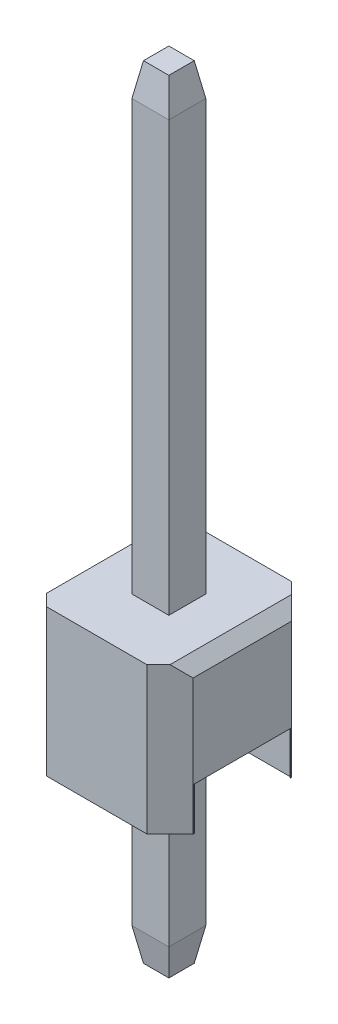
ISO-10303-21;
HEADER;
FILE_DESCRIPTION(('STEP AP214'),'2;1');
FILE_NAME('part.step','',(''),(''),'','','');
FILE_SCHEMA(('AUTOMOTIVE_DESIGN { 1 0 10303 214 1 1 1 1 }'));
ENDSEC;
DATA;
#1=APPLICATION_CONTEXT('core data for automotive mechanical design processes');
#2=APPLICATION_PROTOCOL_DEFINITION('international standard','automotive_design',2000,#1);
#3=PRODUCT_CONTEXT('',#1,'mechanical');
#4=PRODUCT('Part','Part','',(#3));
#5=PRODUCT_RELATED_PRODUCT_CATEGORY('part','',(#4));
#6=PRODUCT_DEFINITION_FORMATION('','',#4);
#7=PRODUCT_DEFINITION_CONTEXT('part definition',#1,'design');
#8=PRODUCT_DEFINITION('design','',#6,#7);
#9=PRODUCT_DEFINITION_SHAPE('','',#8);
#10=(LENGTH_UNIT() NAMED_UNIT(*) SI_UNIT(.MILLI.,.METRE.));
#11=(NAMED_UNIT(*) PLANE_ANGLE_UNIT() SI_UNIT($,.RADIAN.));
#12=(NAMED_UNIT(*) SI_UNIT($,.STERADIAN.) SOLID_ANGLE_UNIT());
#13=UNCERTAINTY_MEASURE_WITH_UNIT(LENGTH_MEASURE(1.E-05),#10,'distance_accuracy_value','');
#14=(GEOMETRIC_REPRESENTATION_CONTEXT(3) GLOBAL_UNCERTAINTY_ASSIGNED_CONTEXT((#13)) GLOBAL_UNIT_ASSIGNED_CONTEXT((#10,
#11,#12)) REPRESENTATION_CONTEXT('',''));
#15=CARTESIAN_POINT('',(0.,0.,0.));
#16=DIRECTION('',(0.,0.,1.));
#17=DIRECTION('',(1.,0.,0.));
#18=AXIS2_PLACEMENT_3D('',#15,#16,#17);
#19=CARTESIAN_POINT('',(0.,10.54,-0.22));
#20=DIRECTION('',(0.,0.173648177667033,-0.98480775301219));
#21=DIRECTION('',(0.,0.98480775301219,0.173648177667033));
#22=AXIS2_PLACEMENT_3D('',#19,#20,#21);
#23=PLANE('',#22);
#24=DIRECTION('',(-0.171087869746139,-0.970287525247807,-0.171087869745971));
#25=VECTOR('',#24,1.);
#26=CARTESIAN_POINT('',(-0.22,10.54,-0.22));
#27=LINE('',#26,#25);
#28=CARTESIAN_POINT('',(-0.22,10.54,-0.22));
#29=VERTEX_POINT('',#28);
#30=CARTESIAN_POINT('',(-0.320000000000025,9.97287181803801,-0.320000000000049));
#31=VERTEX_POINT('',#30);
#32=EDGE_CURVE('P0_E96',#29,#31,#27,.T.);
#33=ORIENTED_EDGE('',*,*,#32,.F.);
#34=DIRECTION('',(1.,0.,0.));
#35=VECTOR('',#34,1.);
#36=CARTESIAN_POINT('',(0.,10.54,-0.22));
#37=LINE('',#36,#35);
#38=CARTESIAN_POINT('',(0.22,10.54,-0.22));
#39=VERTEX_POINT('',#38);
#40=EDGE_CURVE('P0_E20',#39,#29,#37,.F.);
#41=ORIENTED_EDGE('',*,*,#40,.F.);
#42=DIRECTION('',(-0.171087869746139,0.970287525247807,0.171087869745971));
#43=VECTOR('',#42,1.);
#44=CARTESIAN_POINT('',(0.320000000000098,9.97287181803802,-0.32));
#45=LINE('',#44,#43);
#46=CARTESIAN_POINT('',(0.320000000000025,9.97287181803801,-0.320000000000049));
#47=VERTEX_POINT('',#46);
#48=EDGE_CURVE('P0_E84',#47,#39,#45,.T.);
#49=ORIENTED_EDGE('',*,*,#48,.F.);
#50=DIRECTION('',(1.,0.,0.));
#51=VECTOR('',#50,1.);
#52=CARTESIAN_POINT('',(-0.32,9.972871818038,-0.32));
#53=LINE('',#52,#51);
#54=EDGE_CURVE('P0_E120',#47,#31,#53,.F.);
#55=ORIENTED_EDGE('',*,*,#54,.T.);
#56=EDGE_LOOP('',(#33,#41,#49,#55));
#57=FACE_BOUND('',#56,.T.);
#58=ADVANCED_FACE('P0_F17',(#57),#23,.T.);
#59=CARTESIAN_POINT('',(-0.32,-2.432871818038,-0.32));
#60=DIRECTION('',(0.,0.173648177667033,0.98480775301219));
#61=DIRECTION('',(0.,-0.98480775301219,0.173648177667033));
#62=AXIS2_PLACEMENT_3D('',#59,#60,#61);
#63=PLANE('',#62);
#64=DIRECTION('',(1.,0.,0.));
#65=VECTOR('',#64,1.);
#66=CARTESIAN_POINT('',(-0.32,-2.432871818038,-0.32));
#67=LINE('',#66,#65);
#68=CARTESIAN_POINT('',(-0.32,-2.432871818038,-0.32));
#69=VERTEX_POINT('',#68);
#70=CARTESIAN_POINT('',(0.32,-2.432871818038,-0.32));
#71=VERTEX_POINT('',#70);
#72=EDGE_CURVE('P0_E122',#69,#71,#67,.T.);
#73=ORIENTED_EDGE('',*,*,#72,.T.);
#74=DIRECTION('',(-0.171087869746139,-0.970287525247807,0.171087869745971));
#75=VECTOR('',#74,1.);
#76=CARTESIAN_POINT('',(0.32,-2.432871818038,-0.32));
#77=LINE('',#76,#75);
#78=CARTESIAN_POINT('',(0.219999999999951,-2.99999999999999,-0.219999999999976));
#79=VERTEX_POINT('',#78);
#80=EDGE_CURVE('P0_E78',#71,#79,#77,.T.);
#81=ORIENTED_EDGE('',*,*,#80,.T.);
#82=DIRECTION('',(1.,0.,0.));
#83=VECTOR('',#82,1.);
#84=CARTESIAN_POINT('',(0.,-3.,-0.22));
#85=LINE('',#84,#83);
#86=CARTESIAN_POINT('',(-0.219999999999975,-2.99999999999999,-0.219999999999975));
#87=VERTEX_POINT('',#86);
#88=EDGE_CURVE('P0_E109',#79,#87,#85,.F.);
#89=ORIENTED_EDGE('',*,*,#88,.T.);
#90=DIRECTION('',(-0.171087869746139,0.970287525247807,-0.171087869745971));
#91=VECTOR('',#90,1.);
#92=CARTESIAN_POINT('',(-0.219999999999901,-2.99999999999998,-0.22));
#93=LINE('',#92,#91);
#94=EDGE_CURVE('P0_E117',#87,#69,#93,.T.);
#95=ORIENTED_EDGE('',*,*,#94,.T.);
#96=EDGE_LOOP('',(#73,#81,#89,#95));
#97=FACE_BOUND('',#96,.T.);
#98=ADVANCED_FACE('P0_F213',(#97),#63,.F.);
#99=CARTESIAN_POINT('',(0.,10.54,0.));
#100=DIRECTION('',(0.,1.,0.));
#101=DIRECTION('',(0.,0.,1.));
#102=AXIS2_PLACEMENT_3D('',#99,#100,#101);
#103=PLANE('',#102);
#104=DIRECTION('',(1.,0.,0.));
#105=VECTOR('',#104,1.);
#106=CARTESIAN_POINT('',(0.,10.54,0.22));
#107=LINE('',#106,#105);
#108=CARTESIAN_POINT('',(0.22,10.54,0.22));
#109=VERTEX_POINT('',#108);
#110=CARTESIAN_POINT('',(-0.22,10.54,0.22));
#111=VERTEX_POINT('',#110);
#112=EDGE_CURVE('P0_E102',#109,#111,#107,.F.);
#113=ORIENTED_EDGE('',*,*,#112,.F.);
#114=DIRECTION('',(0.,0.,1.));
#115=VECTOR('',#114,1.);
#116=CARTESIAN_POINT('',(0.22,10.54,0.));
#117=LINE('',#116,#115);
#118=EDGE_CURVE('P0_E89',#39,#109,#117,.T.);
#119=ORIENTED_EDGE('',*,*,#118,.F.);
#120=ORIENTED_EDGE('',*,*,#40,.T.);
#121=DIRECTION('',(0.,0.,1.));
#122=VECTOR('',#121,1.);
#123=CARTESIAN_POINT('',(-0.22,10.54,0.));
#124=LINE('',#123,#122);
#125=EDGE_CURVE('P0_E112',#111,#29,#124,.F.);
#126=ORIENTED_EDGE('',*,*,#125,.F.);
#127=EDGE_LOOP('',(#113,#119,#120,#126));
#128=FACE_BOUND('',#127,.T.);
#129=ADVANCED_FACE('P0_F101',(#128),#103,.T.);
#130=CARTESIAN_POINT('',(0.22,10.54,0.));
#131=DIRECTION('',(0.98480775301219,0.173648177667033,0.));
#132=DIRECTION('',(-0.173648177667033,0.98480775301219,0.));
#133=AXIS2_PLACEMENT_3D('',#130,#131,#132);
#134=PLANE('',#133);
#135=ORIENTED_EDGE('',*,*,#48,.T.);
#136=ORIENTED_EDGE('',*,*,#118,.T.);
#137=DIRECTION('',(-0.171087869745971,0.970287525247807,-0.171087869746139));
#138=VECTOR('',#137,1.);
#139=CARTESIAN_POINT('',(0.32,9.97287181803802,0.320000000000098));
#140=LINE('',#139,#138);
#141=CARTESIAN_POINT('',(0.320000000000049,9.97287181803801,0.320000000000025));
#142=VERTEX_POINT('',#141);
#143=EDGE_CURVE('P0_E124',#142,#109,#140,.T.);
#144=ORIENTED_EDGE('',*,*,#143,.F.);
#145=DIRECTION('',(0.,0.,1.));
#146=VECTOR('',#145,1.);
#147=CARTESIAN_POINT('',(0.32,9.972871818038,0.32));
#148=LINE('',#147,#146);
#149=EDGE_CURVE('P0_E91',#142,#47,#148,.F.);
#150=ORIENTED_EDGE('',*,*,#149,.T.);
#151=EDGE_LOOP('',(#135,#136,#144,#150));
#152=FACE_BOUND('',#151,.T.);
#153=ADVANCED_FACE('P0_F86',(#152),#134,.T.);
#154=CARTESIAN_POINT('',(0.32,-2.432871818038,0.32));
#155=DIRECTION('',(-0.98480775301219,0.173648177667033,0.));
#156=DIRECTION('',(-0.173648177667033,-0.98480775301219,0.));
#157=AXIS2_PLACEMENT_3D('',#154,#155,#156);
#158=PLANE('',#157);
#159=DIRECTION('',(0.,0.,1.));
#160=VECTOR('',#159,1.);
#161=CARTESIAN_POINT('',(0.22,-3.,0.));
#162=LINE('',#161,#160);
#163=CARTESIAN_POINT('',(0.219999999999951,-2.99999999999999,0.219999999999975));
#164=VERTEX_POINT('',#163);
#165=EDGE_CURVE('P0_E104',#164,#79,#162,.F.);
#166=ORIENTED_EDGE('',*,*,#165,.T.);
#167=ORIENTED_EDGE('',*,*,#80,.F.);
#168=DIRECTION('',(0.,0.,1.));
#169=VECTOR('',#168,1.);
#170=CARTESIAN_POINT('',(0.32,-2.432871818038,0.32));
#171=LINE('',#170,#169);
#172=CARTESIAN_POINT('',(0.32,-2.432871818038,0.32));
#173=VERTEX_POINT('',#172);
#174=EDGE_CURVE('P0_E133',#71,#173,#171,.T.);
#175=ORIENTED_EDGE('',*,*,#174,.T.);
#176=DIRECTION('',(-0.171087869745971,-0.970287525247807,-0.171087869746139));
#177=VECTOR('',#176,1.);
#178=CARTESIAN_POINT('',(0.32,-2.432871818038,0.32));
#179=LINE('',#178,#177);
#180=EDGE_CURVE('P0_E136',#173,#164,#179,.T.);
#181=ORIENTED_EDGE('',*,*,#180,.T.);
#182=EDGE_LOOP('',(#166,#167,#175,#181));
#183=FACE_BOUND('',#182,.T.);
#184=ADVANCED_FACE('P0_F205',(#183),#158,.F.);
#185=CARTESIAN_POINT('',(0.,-3.,0.));
#186=DIRECTION('',(0.,1.,0.));
#187=DIRECTION('',(0.,0.,1.));
#188=AXIS2_PLACEMENT_3D('',#185,#186,#187);
#189=PLANE('',#188);
#190=ORIENTED_EDGE('',*,*,#165,.F.);
#191=DIRECTION('',(1.,0.,0.));
#192=VECTOR('',#191,1.);
#193=CARTESIAN_POINT('',(-0.32,-2.99999999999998,0.219999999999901));
#194=LINE('',#193,#192);
#195=CARTESIAN_POINT('',(-0.219999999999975,-2.99999999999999,0.219999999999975));
#196=VERTEX_POINT('',#195);
#197=EDGE_CURVE('P0_E139',#164,#196,#194,.F.);
#198=ORIENTED_EDGE('',*,*,#197,.T.);
#199=DIRECTION('',(0.,0.,1.));
#200=VECTOR('',#199,1.);
#201=CARTESIAN_POINT('',(-0.219999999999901,-2.99999999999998,0.32));
#202=LINE('',#201,#200);
#203=EDGE_CURVE('P0_E114',#196,#87,#202,.F.);
#204=ORIENTED_EDGE('',*,*,#203,.T.);
#205=ORIENTED_EDGE('',*,*,#88,.F.);
#206=EDGE_LOOP('',(#190,#198,#204,#205));
#207=FACE_BOUND('',#206,.T.);
#208=ADVANCED_FACE('P0_F202',(#207),#189,.F.);
#209=CARTESIAN_POINT('',(-0.22,10.54,0.));
#210=DIRECTION('',(-0.98480775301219,0.173648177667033,0.));
#211=DIRECTION('',(-0.173648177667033,-0.98480775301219,0.));
#212=AXIS2_PLACEMENT_3D('',#209,#210,#211);
#213=PLANE('',#212);
#214=DIRECTION('',(-0.171087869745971,-0.970287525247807,0.171087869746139));
#215=VECTOR('',#214,1.);
#216=CARTESIAN_POINT('',(-0.22,10.54,0.22));
#217=LINE('',#216,#215);
#218=CARTESIAN_POINT('',(-0.320000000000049,9.97287181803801,0.320000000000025));
#219=VERTEX_POINT('',#218);
#220=EDGE_CURVE('P0_E127',#111,#219,#217,.T.);
#221=ORIENTED_EDGE('',*,*,#220,.F.);
#222=ORIENTED_EDGE('',*,*,#125,.T.);
#223=ORIENTED_EDGE('',*,*,#32,.T.);
#224=DIRECTION('',(0.,0.,-1.));
#225=VECTOR('',#224,1.);
#226=CARTESIAN_POINT('',(-0.32,9.972871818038,0.32));
#227=LINE('',#226,#225);
#228=EDGE_CURVE('P0_E144',#31,#219,#227,.F.);
#229=ORIENTED_EDGE('',*,*,#228,.T.);
#230=EDGE_LOOP('',(#221,#222,#223,#229));
#231=FACE_BOUND('',#230,.T.);
#232=ADVANCED_FACE('P0_F176',(#231),#213,.T.);
#233=CARTESIAN_POINT('',(-0.32,-2.432871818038,0.32));
#234=DIRECTION('',(0.98480775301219,0.173648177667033,0.));
#235=DIRECTION('',(-0.173648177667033,0.98480775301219,0.));
#236=AXIS2_PLACEMENT_3D('',#233,#234,#235);
#237=PLANE('',#236);
#238=ORIENTED_EDGE('',*,*,#203,.F.);
#239=DIRECTION('',(-0.171087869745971,0.970287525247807,0.171087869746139));
#240=VECTOR('',#239,1.);
#241=CARTESIAN_POINT('',(-0.22,-2.99999999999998,0.219999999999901));
#242=LINE('',#241,#240);
#243=CARTESIAN_POINT('',(-0.32,-2.432871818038,0.32));
#244=VERTEX_POINT('',#243);
#245=EDGE_CURVE('P0_E142',#196,#244,#242,.T.);
#246=ORIENTED_EDGE('',*,*,#245,.T.);
#247=DIRECTION('',(0.,0.,-1.));
#248=VECTOR('',#247,1.);
#249=CARTESIAN_POINT('',(-0.32,-2.432871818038,0.32));
#250=LINE('',#249,#248);
#251=EDGE_CURVE('P0_E34',#244,#69,#250,.T.);
#252=ORIENTED_EDGE('',*,*,#251,.T.);
#253=ORIENTED_EDGE('',*,*,#94,.F.);
#254=EDGE_LOOP('',(#238,#246,#252,#253));
#255=FACE_BOUND('',#254,.T.);
#256=ADVANCED_FACE('P0_F195',(#255),#237,.F.);
#257=CARTESIAN_POINT('',(-0.32,10.54,-0.32));
#258=DIRECTION('',(0.,0.,1.));
#259=DIRECTION('',(1.,0.,0.));
#260=AXIS2_PLACEMENT_3D('',#257,#258,#259);
#261=PLANE('',#260);
#262=ORIENTED_EDGE('',*,*,#72,.F.);
#263=DIRECTION('',(0.,1.,0.));
#264=VECTOR('',#263,1.);
#265=CARTESIAN_POINT('',(-0.32,10.54,-0.32));
#266=LINE('',#265,#264);
#267=EDGE_CURVE('P0_E148',#69,#31,#266,.T.);
#268=ORIENTED_EDGE('',*,*,#267,.T.);
#269=ORIENTED_EDGE('',*,*,#54,.F.);
#270=DIRECTION('',(0.,1.,0.));
#271=VECTOR('',#270,1.);
#272=CARTESIAN_POINT('',(0.32,10.54,-0.32));
#273=LINE('',#272,#271);
#274=EDGE_CURVE('P0_E130',#47,#71,#273,.F.);
#275=ORIENTED_EDGE('',*,*,#274,.T.);
#276=EDGE_LOOP('',(#262,#268,#269,#275));
#277=FACE_BOUND('',#276,.T.);
#278=ADVANCED_FACE('P0_F192',(#277),#261,.F.);
#279=CARTESIAN_POINT('',(0.,10.54,0.22));
#280=DIRECTION('',(0.,0.173648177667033,0.98480775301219));
#281=DIRECTION('',(0.,-0.98480775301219,0.173648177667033));
#282=AXIS2_PLACEMENT_3D('',#279,#280,#281);
#283=PLANE('',#282);
#284=ORIENTED_EDGE('',*,*,#220,.T.);
#285=DIRECTION('',(-1.,0.,0.));
#286=VECTOR('',#285,1.);
#287=CARTESIAN_POINT('',(-0.32,9.972871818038,0.32));
#288=LINE('',#287,#286);
#289=EDGE_CURVE('P0_E151',#219,#142,#288,.F.);
#290=ORIENTED_EDGE('',*,*,#289,.T.);
#291=ORIENTED_EDGE('',*,*,#143,.T.);
#292=ORIENTED_EDGE('',*,*,#112,.T.);
#293=EDGE_LOOP('',(#284,#290,#291,#292));
#294=FACE_BOUND('',#293,.T.);
#295=ADVANCED_FACE('P0_F172',(#294),#283,.T.);
#296=CARTESIAN_POINT('',(0.32,10.54,0.32));
#297=DIRECTION('',(-1.,0.,0.));
#298=DIRECTION('',(0.,0.,1.));
#299=AXIS2_PLACEMENT_3D('',#296,#297,#298);
#300=PLANE('',#299);
#301=ORIENTED_EDGE('',*,*,#174,.F.);
#302=ORIENTED_EDGE('',*,*,#274,.F.);
#303=ORIENTED_EDGE('',*,*,#149,.F.);
#304=DIRECTION('',(0.,1.,0.));
#305=VECTOR('',#304,1.);
#306=CARTESIAN_POINT('',(0.32,10.54,0.32));
#307=LINE('',#306,#305);
#308=EDGE_CURVE('P0_E154',#142,#173,#307,.F.);
#309=ORIENTED_EDGE('',*,*,#308,.T.);
#310=EDGE_LOOP('',(#301,#302,#303,#309));
#311=FACE_BOUND('',#310,.T.);
#312=ADVANCED_FACE('P0_F170',(#311),#300,.F.);
#313=CARTESIAN_POINT('',(-0.32,-2.432871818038,0.32));
#314=DIRECTION('',(0.,0.173648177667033,-0.98480775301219));
#315=DIRECTION('',(0.,0.98480775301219,0.173648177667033));
#316=AXIS2_PLACEMENT_3D('',#313,#314,#315);
#317=PLANE('',#316);
#318=ORIENTED_EDGE('',*,*,#197,.F.);
#319=ORIENTED_EDGE('',*,*,#180,.F.);
#320=DIRECTION('',(-1.,0.,0.));
#321=VECTOR('',#320,1.);
#322=CARTESIAN_POINT('',(-0.32,-2.432871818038,0.32));
#323=LINE('',#322,#321);
#324=EDGE_CURVE('P0_E26',#173,#244,#323,.T.);
#325=ORIENTED_EDGE('',*,*,#324,.T.);
#326=ORIENTED_EDGE('',*,*,#245,.F.);
#327=EDGE_LOOP('',(#318,#319,#325,#326));
#328=FACE_BOUND('',#327,.T.);
#329=ADVANCED_FACE('P0_F162',(#328),#317,.F.);
#330=CARTESIAN_POINT('',(-0.32,10.54,0.32));
#331=DIRECTION('',(1.,0.,0.));
#332=DIRECTION('',(0.,0.,-1.));
#333=AXIS2_PLACEMENT_3D('',#330,#331,#332);
#334=PLANE('',#333);
#335=ORIENTED_EDGE('',*,*,#251,.F.);
#336=DIRECTION('',(0.,1.,0.));
#337=VECTOR('',#336,1.);
#338=CARTESIAN_POINT('',(-0.32,10.54,0.32));
#339=LINE('',#338,#337);
#340=EDGE_CURVE('P0_E11',#244,#219,#339,.T.);
#341=ORIENTED_EDGE('',*,*,#340,.T.);
#342=ORIENTED_EDGE('',*,*,#228,.F.);
#343=ORIENTED_EDGE('',*,*,#267,.F.);
#344=EDGE_LOOP('',(#335,#341,#342,#343));
#345=FACE_BOUND('',#344,.T.);
#346=ADVANCED_FACE('P0_F177',(#345),#334,.F.);
#347=CARTESIAN_POINT('',(-0.32,10.54,0.32));
#348=DIRECTION('',(0.,0.,-1.));
#349=DIRECTION('',(-1.,0.,0.));
#350=AXIS2_PLACEMENT_3D('',#347,#348,#349);
#351=PLANE('',#350);
#352=ORIENTED_EDGE('',*,*,#324,.F.);
#353=ORIENTED_EDGE('',*,*,#308,.F.);
#354=ORIENTED_EDGE('',*,*,#289,.F.);
#355=ORIENTED_EDGE('',*,*,#340,.F.);
#356=EDGE_LOOP('',(#352,#353,#354,#355));
#357=FACE_BOUND('',#356,.T.);
#358=ADVANCED_FACE('P0_F166',(#357),#351,.F.);
#359=CLOSED_SHELL('',(#58,#98,#129,#153,#184,#208,#232,#256,#278,#295,#312,#329,#346,#358));
#360=MANIFOLD_SOLID_BREP('P0_B1',#359);
#361=CARTESIAN_POINT('',(1.275,0.,-0.83));
#362=DIRECTION('',(0.,0.,-1.));
#363=DIRECTION('',(-1.,0.,0.));
#364=AXIS2_PLACEMENT_3D('',#361,#362,#363);
#365=PLANE('',#364);
#366=DIRECTION('',(0.707106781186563,0.707106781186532,0.));
#367=VECTOR('',#366,1.);
#368=CARTESIAN_POINT('',(1.265,0.735,-0.83));
#369=LINE('',#368,#367);
#370=CARTESIAN_POINT('',(1.265,0.735,-0.83));
#371=VERTEX_POINT('',#370);
#372=CARTESIAN_POINT('',(1.27,0.74,-0.83));
#373=VERTEX_POINT('',#372);
#374=EDGE_CURVE('P1_E200',#371,#373,#369,.T.);
#375=ORIENTED_EDGE('',*,*,#374,.F.);
#376=DIRECTION('',(0.,1.,0.));
#377=VECTOR('',#376,1.);
#378=CARTESIAN_POINT('',(1.265,0.,-0.83));
#379=LINE('',#378,#377);
#380=CARTESIAN_POINT('',(1.265,0.,-0.83));
#381=VERTEX_POINT('',#380);
#382=EDGE_CURVE('P1_E244',#371,#381,#379,.F.);
#383=ORIENTED_EDGE('',*,*,#382,.T.);
#384=DIRECTION('',(-1.,0.,0.));
#385=VECTOR('',#384,1.);
#386=CARTESIAN_POINT('',(1.275,0.,-0.83));
#387=LINE('',#386,#385);
#388=CARTESIAN_POINT('',(1.275,0.,-0.83));
#389=VERTEX_POINT('',#388);
#390=EDGE_CURVE('P1_E20',#389,#381,#387,.T.);
#391=ORIENTED_EDGE('',*,*,#390,.F.);
#392=DIRECTION('',(0.,1.,0.));
#393=VECTOR('',#392,1.);
#394=CARTESIAN_POINT('',(1.275,0.,-0.83));
#395=LINE('',#394,#393);
#396=CARTESIAN_POINT('',(1.275,0.74,-0.83));
#397=VERTEX_POINT('',#396);
#398=EDGE_CURVE('P1_E203',#397,#389,#395,.F.);
#399=ORIENTED_EDGE('',*,*,#398,.F.);
#400=DIRECTION('',(-1.,0.,0.));
#401=VECTOR('',#400,1.);
#402=CARTESIAN_POINT('',(1.275,0.74,-0.83));
#403=LINE('',#402,#401);
#404=EDGE_CURVE('P1_E196',#373,#397,#403,.F.);
#405=ORIENTED_EDGE('',*,*,#404,.F.);
#406=EDGE_LOOP('',(#375,#383,#391,#399,#405));
#407=FACE_BOUND('',#406,.T.);
#408=ADVANCED_FACE('P1_F17',(#407),#365,.F.);
#409=CARTESIAN_POINT('',(1.275,0.74,0.83));
#410=DIRECTION('',(0.,0.,1.));
#411=DIRECTION('',(1.,0.,0.));
#412=AXIS2_PLACEMENT_3D('',#409,#410,#411);
#413=PLANE('',#412);
#414=DIRECTION('',(-0.707106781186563,-0.707106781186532,0.));
#415=VECTOR('',#414,1.);
#416=CARTESIAN_POINT('',(1.27,0.74,0.83));
#417=LINE('',#416,#415);
#418=CARTESIAN_POINT('',(1.27,0.74,0.83));
#419=VERTEX_POINT('',#418);
#420=CARTESIAN_POINT('',(1.265,0.735,0.83));
#421=VERTEX_POINT('',#420);
#422=EDGE_CURVE('P1_E191',#419,#421,#417,.T.);
#423=ORIENTED_EDGE('',*,*,#422,.F.);
#424=DIRECTION('',(1.,0.,0.));
#425=VECTOR('',#424,1.);
#426=CARTESIAN_POINT('',(1.275,0.74,0.83));
#427=LINE('',#426,#425);
#428=CARTESIAN_POINT('',(1.275,0.74,0.83));
#429=VERTEX_POINT('',#428);
#430=EDGE_CURVE('P1_E234',#429,#419,#427,.F.);
#431=ORIENTED_EDGE('',*,*,#430,.F.);
#432=DIRECTION('',(0.,1.,0.));
#433=VECTOR('',#432,1.);
#434=CARTESIAN_POINT('',(1.275,0.,0.83));
#435=LINE('',#434,#433);
#436=CARTESIAN_POINT('',(1.275,0.,0.83));
#437=VERTEX_POINT('',#436);
#438=EDGE_CURVE('P1_E247',#429,#437,#435,.F.);
#439=ORIENTED_EDGE('',*,*,#438,.T.);
#440=DIRECTION('',(1.,0.,0.));
#441=VECTOR('',#440,1.);
#442=CARTESIAN_POINT('',(1.275,0.,0.83));
#443=LINE('',#442,#441);
#444=CARTESIAN_POINT('',(1.265,0.,0.83));
#445=VERTEX_POINT('',#444);
#446=EDGE_CURVE('P1_E206',#445,#437,#443,.T.);
#447=ORIENTED_EDGE('',*,*,#446,.F.);
#448=DIRECTION('',(0.,1.,0.));
#449=VECTOR('',#448,1.);
#450=CARTESIAN_POINT('',(1.265,0.,0.83));
#451=LINE('',#450,#449);
#452=EDGE_CURVE('P1_E237',#421,#445,#451,.F.);
#453=ORIENTED_EDGE('',*,*,#452,.F.);
#454=EDGE_LOOP('',(#423,#431,#439,#447,#453));
#455=FACE_BOUND('',#454,.T.);
#456=ADVANCED_FACE('P1_F550',(#455),#413,.F.);
#457=CARTESIAN_POINT('',(1.265,0.,0.));
#458=DIRECTION('',(-1.,0.,0.));
#459=DIRECTION('',(0.,0.,1.));
#460=AXIS2_PLACEMENT_3D('',#457,#458,#459);
#461=PLANE('',#460);
#462=DIRECTION('',(0.,0.,1.));
#463=VECTOR('',#462,1.);
#464=CARTESIAN_POINT('',(1.265,0.,0.));
#465=LINE('',#464,#463);
#466=CARTESIAN_POINT('',(1.265,0.,0.85));
#467=VERTEX_POINT('',#466);
#468=EDGE_CURVE('P1_E240',#445,#467,#465,.T.);
#469=ORIENTED_EDGE('',*,*,#468,.T.);
#470=DIRECTION('',(0.,1.,0.));
#471=VECTOR('',#470,1.);
#472=CARTESIAN_POINT('',(1.265,0.,0.85));
#473=LINE('',#472,#471);
#474=CARTESIAN_POINT('',(1.265,0.735,0.85));
#475=VERTEX_POINT('',#474);
#476=EDGE_CURVE('P1_E264',#467,#475,#473,.T.);
#477=ORIENTED_EDGE('',*,*,#476,.T.);
#478=DIRECTION('',(0.,0.,1.));
#479=VECTOR('',#478,1.);
#480=CARTESIAN_POINT('',(1.265,0.735,-0.85));
#481=LINE('',#480,#479);
#482=EDGE_CURVE('P1_E258',#475,#421,#481,.F.);
#483=ORIENTED_EDGE('',*,*,#482,.T.);
#484=ORIENTED_EDGE('',*,*,#452,.T.);
#485=EDGE_LOOP('',(#469,#477,#483,#484));
#486=FACE_BOUND('',#485,.T.);
#487=ADVANCED_FACE('P1_F547',(#486),#461,.T.);
#488=CARTESIAN_POINT('',(1.265,0.,0.));
#489=DIRECTION('',(1.,0.,0.));
#490=DIRECTION('',(0.,0.,-1.));
#491=AXIS2_PLACEMENT_3D('',#488,#489,#490);
#492=PLANE('',#491);
#493=DIRECTION('',(0.,0.,1.));
#494=VECTOR('',#493,1.);
#495=CARTESIAN_POINT('',(1.265,0.735,-0.85));
#496=LINE('',#495,#494);
#497=CARTESIAN_POINT('',(1.265,0.735,-0.85));
#498=VERTEX_POINT('',#497);
#499=EDGE_CURVE('P1_E230',#371,#498,#496,.F.);
#500=ORIENTED_EDGE('',*,*,#499,.T.);
#501=DIRECTION('',(0.,1.,0.));
#502=VECTOR('',#501,1.);
#503=CARTESIAN_POINT('',(1.265,0.,-0.85));
#504=LINE('',#503,#502);
#505=CARTESIAN_POINT('',(1.265,0.,-0.85));
#506=VERTEX_POINT('',#505);
#507=EDGE_CURVE('P1_E274',#498,#506,#504,.F.);
#508=ORIENTED_EDGE('',*,*,#507,.T.);
#509=DIRECTION('',(0.,0.,-1.));
#510=VECTOR('',#509,1.);
#511=CARTESIAN_POINT('',(1.265,0.,0.));
#512=LINE('',#511,#510);
#513=EDGE_CURVE('P1_E242',#381,#506,#512,.T.);
#514=ORIENTED_EDGE('',*,*,#513,.F.);
#515=ORIENTED_EDGE('',*,*,#382,.F.);
#516=EDGE_LOOP('',(#500,#508,#514,#515));
#517=FACE_BOUND('',#516,.T.);
#518=ADVANCED_FACE('P1_F543',(#517),#492,.F.);
#519=CARTESIAN_POINT('',(1.275,0.,0.));
#520=DIRECTION('',(1.,0.,0.));
#521=DIRECTION('',(0.,0.,-1.));
#522=AXIS2_PLACEMENT_3D('',#519,#520,#521);
#523=PLANE('',#522);
#524=DIRECTION('',(0.,0.,-1.));
#525=VECTOR('',#524,1.);
#526=CARTESIAN_POINT('',(1.275,0.74,-0.83));
#527=LINE('',#526,#525);
#528=CARTESIAN_POINT('',(1.275,0.74,-0.85));
#529=VERTEX_POINT('',#528);
#530=EDGE_CURVE('P1_E252',#529,#397,#527,.F.);
#531=ORIENTED_EDGE('',*,*,#530,.T.);
#532=ORIENTED_EDGE('',*,*,#398,.T.);
#533=DIRECTION('',(0.,0.,-1.));
#534=VECTOR('',#533,1.);
#535=CARTESIAN_POINT('',(1.275,0.,0.));
#536=LINE('',#535,#534);
#537=CARTESIAN_POINT('',(1.275,0.,-0.85));
#538=VERTEX_POINT('',#537);
#539=EDGE_CURVE('P1_E282',#538,#389,#536,.F.);
#540=ORIENTED_EDGE('',*,*,#539,.F.);
#541=DIRECTION('',(0.,1.,0.));
#542=VECTOR('',#541,1.);
#543=CARTESIAN_POINT('',(1.275,0.,-0.85));
#544=LINE('',#543,#542);
#545=EDGE_CURVE('P1_E285',#538,#529,#544,.T.);
#546=ORIENTED_EDGE('',*,*,#545,.T.);
#547=EDGE_LOOP('',(#531,#532,#540,#546));
#548=FACE_BOUND('',#547,.T.);
#549=ADVANCED_FACE('P1_F539',(#548),#523,.T.);
#550=CARTESIAN_POINT('',(1.275,0.,0.));
#551=DIRECTION('',(-1.,0.,0.));
#552=DIRECTION('',(0.,0.,1.));
#553=AXIS2_PLACEMENT_3D('',#550,#551,#552);
#554=PLANE('',#553);
#555=DIRECTION('',(0.,1.,0.));
#556=VECTOR('',#555,1.);
#557=CARTESIAN_POINT('',(1.275,0.74,0.85));
#558=LINE('',#557,#556);
#559=CARTESIAN_POINT('',(1.275,0.74,0.85));
#560=VERTEX_POINT('',#559);
#561=CARTESIAN_POINT('',(1.275,0.,0.85));
#562=VERTEX_POINT('',#561);
#563=EDGE_CURVE('P1_E292',#560,#562,#558,.F.);
#564=ORIENTED_EDGE('',*,*,#563,.T.);
#565=DIRECTION('',(0.,0.,1.));
#566=VECTOR('',#565,1.);
#567=CARTESIAN_POINT('',(1.275,0.,0.));
#568=LINE('',#567,#566);
#569=EDGE_CURVE('P1_E250',#437,#562,#568,.T.);
#570=ORIENTED_EDGE('',*,*,#569,.F.);
#571=ORIENTED_EDGE('',*,*,#438,.F.);
#572=DIRECTION('',(0.,0.,-1.));
#573=VECTOR('',#572,1.);
#574=CARTESIAN_POINT('',(1.275,0.74,0.85));
#575=LINE('',#574,#573);
#576=EDGE_CURVE('P1_E254',#429,#560,#575,.F.);
#577=ORIENTED_EDGE('',*,*,#576,.T.);
#578=EDGE_LOOP('',(#564,#570,#571,#577));
#579=FACE_BOUND('',#578,.T.);
#580=ADVANCED_FACE('P1_F536',(#579),#554,.F.);
#581=CARTESIAN_POINT('',(1.275,0.74,-0.83));
#582=DIRECTION('',(0.,-1.,0.));
#583=DIRECTION('',(0.,0.,-1.));
#584=AXIS2_PLACEMENT_3D('',#581,#582,#583);
#585=PLANE('',#584);
#586=DIRECTION('',(0.,0.,1.));
#587=VECTOR('',#586,1.);
#588=CARTESIAN_POINT('',(1.27,0.74,0.85));
#589=LINE('',#588,#587);
#590=CARTESIAN_POINT('',(1.27,0.74,-0.85));
#591=VERTEX_POINT('',#590);
#592=EDGE_CURVE('P1_E209',#591,#373,#589,.T.);
#593=ORIENTED_EDGE('',*,*,#592,.T.);
#594=ORIENTED_EDGE('',*,*,#404,.T.);
#595=ORIENTED_EDGE('',*,*,#530,.F.);
#596=DIRECTION('',(1.,0.,0.));
#597=VECTOR('',#596,1.);
#598=CARTESIAN_POINT('',(1.275,0.74,-0.85));
#599=LINE('',#598,#597);
#600=EDGE_CURVE('P1_E213',#529,#591,#599,.F.);
#601=ORIENTED_EDGE('',*,*,#600,.T.);
#602=EDGE_LOOP('',(#593,#594,#595,#601));
#603=FACE_BOUND('',#602,.T.);
#604=ADVANCED_FACE('P1_F211',(#603),#585,.F.);
#605=CARTESIAN_POINT('',(1.275,0.74,0.85));
#606=DIRECTION('',(0.,-1.,0.));
#607=DIRECTION('',(0.,0.,-1.));
#608=AXIS2_PLACEMENT_3D('',#605,#606,#607);
#609=PLANE('',#608);
#610=DIRECTION('',(0.,0.,1.));
#611=VECTOR('',#610,1.);
#612=CARTESIAN_POINT('',(1.27,0.74,0.85));
#613=LINE('',#612,#611);
#614=CARTESIAN_POINT('',(1.27,0.74,0.85));
#615=VERTEX_POINT('',#614);
#616=EDGE_CURVE('P1_E223',#419,#615,#613,.T.);
#617=ORIENTED_EDGE('',*,*,#616,.T.);
#618=DIRECTION('',(-1.,0.,0.));
#619=VECTOR('',#618,1.);
#620=CARTESIAN_POINT('',(1.275,0.74,0.85));
#621=LINE('',#620,#619);
#622=EDGE_CURVE('P1_E295',#615,#560,#621,.F.);
#623=ORIENTED_EDGE('',*,*,#622,.T.);
#624=ORIENTED_EDGE('',*,*,#576,.F.);
#625=ORIENTED_EDGE('',*,*,#430,.T.);
#626=EDGE_LOOP('',(#617,#623,#624,#625));
#627=FACE_BOUND('',#626,.T.);
#628=ADVANCED_FACE('P1_F529',(#627),#609,.F.);
#629=CARTESIAN_POINT('',(-1.07,0.54,-0.85));
#630=DIRECTION('',(0.707106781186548,0.707106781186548,0.));
#631=DIRECTION('',(-0.707106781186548,0.707106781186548,0.));
#632=AXIS2_PLACEMENT_3D('',#629,#630,#631);
#633=PLANE('',#632);
#634=DIRECTION('',(0.707106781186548,-0.707106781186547,0.));
#635=VECTOR('',#634,1.);
#636=CARTESIAN_POINT('',(-1.27,0.74,-0.85));
#637=LINE('',#636,#635);
#638=CARTESIAN_POINT('',(-1.27,0.74,-0.85));
#639=VERTEX_POINT('',#638);
#640=CARTESIAN_POINT('',(-1.07,0.54,-0.85));
#641=VERTEX_POINT('',#640);
#642=EDGE_CURVE('P1_E269',#639,#641,#637,.T.);
#643=ORIENTED_EDGE('',*,*,#642,.T.);
#644=DIRECTION('',(0.,0.,1.));
#645=VECTOR('',#644,1.);
#646=CARTESIAN_POINT('',(-1.07,0.54,0.85));
#647=LINE('',#646,#645);
#648=CARTESIAN_POINT('',(-1.07,0.54,0.850000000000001));
#649=VERTEX_POINT('',#648);
#650=EDGE_CURVE('P1_E303',#641,#649,#647,.T.);
#651=ORIENTED_EDGE('',*,*,#650,.T.);
#652=DIRECTION('',(-0.707106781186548,0.707106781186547,0.));
#653=VECTOR('',#652,1.);
#654=CARTESIAN_POINT('',(-1.07,0.54,0.85));
#655=LINE('',#654,#653);
#656=CARTESIAN_POINT('',(-1.27,0.74,0.850000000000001));
#657=VERTEX_POINT('',#656);
#658=EDGE_CURVE('P1_E261',#649,#657,#655,.T.);
#659=ORIENTED_EDGE('',*,*,#658,.T.);
#660=DIRECTION('',(0.,0.,-1.));
#661=VECTOR('',#660,1.);
#662=CARTESIAN_POINT('',(-1.27,0.74,0.85));
#663=LINE('',#662,#661);
#664=EDGE_CURVE('P1_E277',#657,#639,#663,.T.);
#665=ORIENTED_EDGE('',*,*,#664,.T.);
#666=EDGE_LOOP('',(#643,#651,#659,#665));
#667=FACE_BOUND('',#666,.T.);
#668=ADVANCED_FACE('P1_F526',(#667),#633,.F.);
#669=CARTESIAN_POINT('',(1.07,0.54,-0.85));
#670=DIRECTION('',(-0.707106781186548,0.707106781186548,0.));
#671=DIRECTION('',(-0.707106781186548,-0.707106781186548,0.));
#672=AXIS2_PLACEMENT_3D('',#669,#670,#671);
#673=PLANE('',#672);
#674=DIRECTION('',(0.,0.,1.));
#675=VECTOR('',#674,1.);
#676=CARTESIAN_POINT('',(1.27,0.74,0.85));
#677=LINE('',#676,#675);
#678=EDGE_CURVE('P1_E216',#373,#419,#677,.T.);
#679=ORIENTED_EDGE('',*,*,#678,.T.);
#680=ORIENTED_EDGE('',*,*,#422,.T.);
#681=ORIENTED_EDGE('',*,*,#482,.F.);
#682=DIRECTION('',(-0.707106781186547,-0.707106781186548,0.));
#683=VECTOR('',#682,1.);
#684=CARTESIAN_POINT('',(1.265,0.735,0.85));
#685=LINE('',#684,#683);
#686=CARTESIAN_POINT('',(1.07,0.54,0.85));
#687=VERTEX_POINT('',#686);
#688=EDGE_CURVE('P1_E267',#475,#687,#685,.T.);
#689=ORIENTED_EDGE('',*,*,#688,.T.);
#690=DIRECTION('',(0.,0.,1.));
#691=VECTOR('',#690,1.);
#692=CARTESIAN_POINT('',(1.07,0.54,0.85));
#693=LINE('',#692,#691);
#694=CARTESIAN_POINT('',(1.07,0.54,-0.85));
#695=VERTEX_POINT('',#694);
#696=EDGE_CURVE('P1_E309',#687,#695,#693,.F.);
#697=ORIENTED_EDGE('',*,*,#696,.T.);
#698=DIRECTION('',(0.707106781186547,0.707106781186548,0.));
#699=VECTOR('',#698,1.);
#700=CARTESIAN_POINT('',(1.07,0.54,-0.85));
#701=LINE('',#700,#699);
#702=EDGE_CURVE('P1_E272',#695,#498,#701,.T.);
#703=ORIENTED_EDGE('',*,*,#702,.T.);
#704=ORIENTED_EDGE('',*,*,#499,.F.);
#705=ORIENTED_EDGE('',*,*,#374,.T.);
#706=EDGE_LOOP('',(#679,#680,#681,#689,#697,#703,#704,#705));
#707=FACE_BOUND('',#706,.T.);
#708=ADVANCED_FACE('P1_F228',(#707),#673,.F.);
#709=CARTESIAN_POINT('',(-1.27,0.,0.85));
#710=DIRECTION('',(0.,0.,1.));
#711=DIRECTION('',(1.,0.,0.));
#712=AXIS2_PLACEMENT_3D('',#709,#710,#711);
#713=PLANE('',#712);
#714=ORIENTED_EDGE('',*,*,#476,.F.);
#715=DIRECTION('',(1.,0.,0.));
#716=VECTOR('',#715,1.);
#717=CARTESIAN_POINT('',(0.,0.,0.85));
#718=LINE('',#717,#716);
#719=CARTESIAN_POINT('',(-1.27,0.,0.85));
#720=VERTEX_POINT('',#719);
#721=EDGE_CURVE('P1_E298',#720,#467,#718,.T.);
#722=ORIENTED_EDGE('',*,*,#721,.F.);
#723=DIRECTION('',(0.,1.,0.));
#724=VECTOR('',#723,1.);
#725=CARTESIAN_POINT('',(-1.27,2.54,0.85));
#726=LINE('',#725,#724);
#727=EDGE_CURVE('P1_E323',#720,#657,#726,.T.);
#728=ORIENTED_EDGE('',*,*,#727,.T.);
#729=ORIENTED_EDGE('',*,*,#658,.F.);
#730=DIRECTION('',(1.,0.,0.));
#731=VECTOR('',#730,1.);
#732=CARTESIAN_POINT('',(-1.27,0.54,0.85));
#733=LINE('',#732,#731);
#734=EDGE_CURVE('P1_E306',#649,#687,#733,.T.);
#735=ORIENTED_EDGE('',*,*,#734,.T.);
#736=ORIENTED_EDGE('',*,*,#688,.F.);
#737=EDGE_LOOP('',(#714,#722,#728,#729,#735,#736));
#738=FACE_BOUND('',#737,.T.);
#739=ADVANCED_FACE('P1_F519',(#738),#713,.F.);
#740=CARTESIAN_POINT('',(-1.27,0.,-0.85));
#741=DIRECTION('',(0.,0.,-1.));
#742=DIRECTION('',(-1.,0.,0.));
#743=AXIS2_PLACEMENT_3D('',#740,#741,#742);
#744=PLANE('',#743);
#745=ORIENTED_EDGE('',*,*,#702,.F.);
#746=DIRECTION('',(1.,0.,0.));
#747=VECTOR('',#746,1.);
#748=CARTESIAN_POINT('',(-1.27,0.54,-0.85));
#749=LINE('',#748,#747);
#750=EDGE_CURVE('P1_E312',#695,#641,#749,.F.);
#751=ORIENTED_EDGE('',*,*,#750,.T.);
#752=ORIENTED_EDGE('',*,*,#642,.F.);
#753=DIRECTION('',(0.,1.,0.));
#754=VECTOR('',#753,1.);
#755=CARTESIAN_POINT('',(-1.27,2.54,-0.85));
#756=LINE('',#755,#754);
#757=CARTESIAN_POINT('',(-1.27,0.,-0.85));
#758=VERTEX_POINT('',#757);
#759=EDGE_CURVE('P1_E333',#639,#758,#756,.F.);
#760=ORIENTED_EDGE('',*,*,#759,.T.);
#761=DIRECTION('',(1.,0.,0.));
#762=VECTOR('',#761,1.);
#763=CARTESIAN_POINT('',(0.,0.,-0.85));
#764=LINE('',#763,#762);
#765=EDGE_CURVE('P1_E280',#506,#758,#764,.F.);
#766=ORIENTED_EDGE('',*,*,#765,.F.);
#767=ORIENTED_EDGE('',*,*,#507,.F.);
#768=EDGE_LOOP('',(#745,#751,#752,#760,#766,#767));
#769=FACE_BOUND('',#768,.T.);
#770=ADVANCED_FACE('P1_F515',(#769),#744,.F.);
#771=CARTESIAN_POINT('',(-1.27,2.54,0.85));
#772=DIRECTION('',(1.,0.,0.));
#773=DIRECTION('',(0.,0.,-1.));
#774=AXIS2_PLACEMENT_3D('',#771,#772,#773);
#775=PLANE('',#774);
#776=DIRECTION('',(0.,0.,1.));
#777=VECTOR('',#776,1.);
#778=CARTESIAN_POINT('',(-1.27,2.34,0.));
#779=LINE('',#778,#777);
#780=CARTESIAN_POINT('',(-1.27,2.34,0.85));
#781=VERTEX_POINT('',#780);
#782=CARTESIAN_POINT('',(-1.27,2.34,-0.85));
#783=VERTEX_POINT('',#782);
#784=EDGE_CURVE('P1_E331',#781,#783,#779,.F.);
#785=ORIENTED_EDGE('',*,*,#784,.T.);
#786=DIRECTION('',(0.,1.,0.));
#787=VECTOR('',#786,1.);
#788=CARTESIAN_POINT('',(-1.27,2.54,-0.85));
#789=LINE('',#788,#787);
#790=EDGE_CURVE('P1_E341',#783,#639,#789,.F.);
#791=ORIENTED_EDGE('',*,*,#790,.T.);
#792=ORIENTED_EDGE('',*,*,#664,.F.);
#793=DIRECTION('',(0.,1.,0.));
#794=VECTOR('',#793,1.);
#795=CARTESIAN_POINT('',(-1.27,2.54,0.85));
#796=LINE('',#795,#794);
#797=EDGE_CURVE('P1_E326',#657,#781,#796,.T.);
#798=ORIENTED_EDGE('',*,*,#797,.T.);
#799=EDGE_LOOP('',(#785,#791,#792,#798));
#800=FACE_BOUND('',#799,.T.);
#801=ADVANCED_FACE('P1_F511',(#800),#775,.F.);
#802=CARTESIAN_POINT('',(0.,0.,0.));
#803=DIRECTION('',(0.,-1.,0.));
#804=DIRECTION('',(0.,0.,-1.));
#805=AXIS2_PLACEMENT_3D('',#802,#803,#804);
#806=PLANE('',#805);
#807=ORIENTED_EDGE('',*,*,#390,.T.);
#808=ORIENTED_EDGE('',*,*,#513,.T.);
#809=ORIENTED_EDGE('',*,*,#765,.T.);
#810=DIRECTION('',(0.707106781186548,0.,-0.707106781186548));
#811=VECTOR('',#810,1.);
#812=CARTESIAN_POINT('',(-1.27,0.,-0.85));
#813=LINE('',#812,#811);
#814=CARTESIAN_POINT('',(-0.87,0.,-1.25));
#815=VERTEX_POINT('',#814);
#816=EDGE_CURVE('P1_E336',#758,#815,#813,.T.);
#817=ORIENTED_EDGE('',*,*,#816,.T.);
#818=DIRECTION('',(1.,0.,0.));
#819=VECTOR('',#818,1.);
#820=CARTESIAN_POINT('',(-0.87,0.,-1.25));
#821=LINE('',#820,#819);
#822=CARTESIAN_POINT('',(0.87,0.,-1.25));
#823=VERTEX_POINT('',#822);
#824=EDGE_CURVE('P1_E347',#815,#823,#821,.T.);
#825=ORIENTED_EDGE('',*,*,#824,.T.);
#826=DIRECTION('',(0.707106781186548,0.,0.707106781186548));
#827=VECTOR('',#826,1.);
#828=CARTESIAN_POINT('',(0.87,0.,-1.25));
#829=LINE('',#828,#827);
#830=CARTESIAN_POINT('',(1.27,0.,-0.85));
#831=VERTEX_POINT('',#830);
#832=EDGE_CURVE('P1_E352',#823,#831,#829,.T.);
#833=ORIENTED_EDGE('',*,*,#832,.T.);
#834=DIRECTION('',(1.,0.,0.));
#835=VECTOR('',#834,1.);
#836=CARTESIAN_POINT('',(1.275,0.,-0.85));
#837=LINE('',#836,#835);
#838=EDGE_CURVE('P1_E289',#831,#538,#837,.T.);
#839=ORIENTED_EDGE('',*,*,#838,.T.);
#840=ORIENTED_EDGE('',*,*,#539,.T.);
#841=EDGE_LOOP('',(#807,#808,#809,#817,#825,#833,#839,#840));
#842=FACE_BOUND('',#841,.T.);
#843=ADVANCED_FACE('P1_F507',(#842),#806,.T.);
#844=CARTESIAN_POINT('',(1.275,0.,-0.85));
#845=DIRECTION('',(0.,0.,1.));
#846=DIRECTION('',(1.,0.,0.));
#847=AXIS2_PLACEMENT_3D('',#844,#845,#846);
#848=PLANE('',#847);
#849=DIRECTION('',(0.,1.,0.));
#850=VECTOR('',#849,1.);
#851=CARTESIAN_POINT('',(1.27,2.54,-0.85));
#852=LINE('',#851,#850);
#853=EDGE_CURVE('P1_E355',#831,#591,#852,.T.);
#854=ORIENTED_EDGE('',*,*,#853,.T.);
#855=ORIENTED_EDGE('',*,*,#600,.F.);
#856=ORIENTED_EDGE('',*,*,#545,.F.);
#857=ORIENTED_EDGE('',*,*,#838,.F.);
#858=EDGE_LOOP('',(#854,#855,#856,#857));
#859=FACE_BOUND('',#858,.T.);
#860=ADVANCED_FACE('P1_F503',(#859),#848,.F.);
#861=CARTESIAN_POINT('',(1.275,0.74,0.85));
#862=DIRECTION('',(0.,0.,-1.));
#863=DIRECTION('',(-1.,0.,0.));
#864=AXIS2_PLACEMENT_3D('',#861,#862,#863);
#865=PLANE('',#864);
#866=DIRECTION('',(0.,1.,0.));
#867=VECTOR('',#866,1.);
#868=CARTESIAN_POINT('',(1.27,2.54,0.85));
#869=LINE('',#868,#867);
#870=CARTESIAN_POINT('',(1.27,0.,0.85));
#871=VERTEX_POINT('',#870);
#872=EDGE_CURVE('P1_E365',#615,#871,#869,.F.);
#873=ORIENTED_EDGE('',*,*,#872,.T.);
#874=DIRECTION('',(1.,0.,0.));
#875=VECTOR('',#874,1.);
#876=CARTESIAN_POINT('',(0.,0.,0.85));
#877=LINE('',#876,#875);
#878=EDGE_CURVE('P1_E217',#562,#871,#877,.F.);
#879=ORIENTED_EDGE('',*,*,#878,.F.);
#880=ORIENTED_EDGE('',*,*,#563,.F.);
#881=ORIENTED_EDGE('',*,*,#622,.F.);
#882=EDGE_LOOP('',(#873,#879,#880,#881));
#883=FACE_BOUND('',#882,.T.);
#884=ADVANCED_FACE('P1_F499',(#883),#865,.F.);
#885=CARTESIAN_POINT('',(0.,0.,0.));
#886=DIRECTION('',(0.,-1.,0.));
#887=DIRECTION('',(0.,0.,-1.));
#888=AXIS2_PLACEMENT_3D('',#885,#886,#887);
#889=PLANE('',#888);
#890=DIRECTION('',(-1.,0.,0.));
#891=VECTOR('',#890,1.);
#892=CARTESIAN_POINT('',(-0.87,0.,1.25));
#893=LINE('',#892,#891);
#894=CARTESIAN_POINT('',(0.87,0.,1.25));
#895=VERTEX_POINT('',#894);
#896=CARTESIAN_POINT('',(-0.87,0.,1.25));
#897=VERTEX_POINT('',#896);
#898=EDGE_CURVE('P1_E315',#895,#897,#893,.T.);
#899=ORIENTED_EDGE('',*,*,#898,.T.);
#900=DIRECTION('',(-0.707106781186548,0.,-0.707106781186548));
#901=VECTOR('',#900,1.);
#902=CARTESIAN_POINT('',(-1.27,0.,0.85));
#903=LINE('',#902,#901);
#904=EDGE_CURVE('P1_E320',#897,#720,#903,.T.);
#905=ORIENTED_EDGE('',*,*,#904,.T.);
#906=ORIENTED_EDGE('',*,*,#721,.T.);
#907=ORIENTED_EDGE('',*,*,#468,.F.);
#908=ORIENTED_EDGE('',*,*,#446,.T.);
#909=ORIENTED_EDGE('',*,*,#569,.T.);
#910=ORIENTED_EDGE('',*,*,#878,.T.);
#911=DIRECTION('',(-0.707106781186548,0.,0.707106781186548));
#912=VECTOR('',#911,1.);
#913=CARTESIAN_POINT('',(0.87,0.,1.25));
#914=LINE('',#913,#912);
#915=EDGE_CURVE('P1_E368',#871,#895,#914,.T.);
#916=ORIENTED_EDGE('',*,*,#915,.T.);
#917=EDGE_LOOP('',(#899,#905,#906,#907,#908,#909,#910,#916));
#918=FACE_BOUND('',#917,.T.);
#919=ADVANCED_FACE('P1_F496',(#918),#889,.T.);
#920=CARTESIAN_POINT('',(1.27,2.54,0.85));
#921=DIRECTION('',(-1.,0.,0.));
#922=DIRECTION('',(0.,0.,1.));
#923=AXIS2_PLACEMENT_3D('',#920,#921,#922);
#924=PLANE('',#923);
#925=DIRECTION('',(0.,0.,1.));
#926=VECTOR('',#925,1.);
#927=CARTESIAN_POINT('',(1.27,2.34,0.));
#928=LINE('',#927,#926);
#929=CARTESIAN_POINT('',(1.27,2.34,-0.85));
#930=VERTEX_POINT('',#929);
#931=CARTESIAN_POINT('',(1.27,2.34,0.85));
#932=VERTEX_POINT('',#931);
#933=EDGE_CURVE('P1_E363',#930,#932,#928,.T.);
#934=ORIENTED_EDGE('',*,*,#933,.T.);
#935=DIRECTION('',(0.,1.,0.));
#936=VECTOR('',#935,1.);
#937=CARTESIAN_POINT('',(1.27,2.54,0.85));
#938=LINE('',#937,#936);
#939=EDGE_CURVE('P1_E377',#932,#615,#938,.F.);
#940=ORIENTED_EDGE('',*,*,#939,.T.);
#941=ORIENTED_EDGE('',*,*,#616,.F.);
#942=ORIENTED_EDGE('',*,*,#678,.F.);
#943=ORIENTED_EDGE('',*,*,#592,.F.);
#944=DIRECTION('',(0.,1.,0.));
#945=VECTOR('',#944,1.);
#946=CARTESIAN_POINT('',(1.27,2.54,-0.85));
#947=LINE('',#946,#945);
#948=EDGE_CURVE('P1_E358',#591,#930,#947,.T.);
#949=ORIENTED_EDGE('',*,*,#948,.T.);
#950=EDGE_LOOP('',(#934,#940,#941,#942,#943,#949));
#951=FACE_BOUND('',#950,.T.);
#952=ADVANCED_FACE('P1_F220',(#951),#924,.F.);
#953=CARTESIAN_POINT('',(-1.27,0.54,0.85));
#954=DIRECTION('',(0.,1.,0.));
#955=DIRECTION('',(0.,0.,1.));
#956=AXIS2_PLACEMENT_3D('',#953,#954,#955);
#957=PLANE('',#956);
#958=ORIENTED_EDGE('',*,*,#696,.F.);
#959=ORIENTED_EDGE('',*,*,#734,.F.);
#960=ORIENTED_EDGE('',*,*,#650,.F.);
#961=ORIENTED_EDGE('',*,*,#750,.F.);
#962=EDGE_LOOP('',(#958,#959,#960,#961));
#963=FACE_BOUND('',#962,.T.);
#964=DIRECTION('',(1.,0.,0.));
#965=VECTOR('',#964,1.);
#966=CARTESIAN_POINT('',(-0.32,0.54,-0.32));
#967=LINE('',#966,#965);
#968=CARTESIAN_POINT('',(-0.32,0.54,-0.32));
#969=VERTEX_POINT('',#968);
#970=CARTESIAN_POINT('',(0.32,0.54,-0.32));
#971=VERTEX_POINT('',#970);
#972=EDGE_CURVE('P1_E379',#969,#971,#967,.T.);
#973=ORIENTED_EDGE('',*,*,#972,.F.);
#974=DIRECTION('',(0.,0.,-1.));
#975=VECTOR('',#974,1.);
#976=CARTESIAN_POINT('',(-0.32,0.54,0.32));
#977=LINE('',#976,#975);
#978=CARTESIAN_POINT('',(-0.32,0.54,0.32));
#979=VERTEX_POINT('',#978);
#980=EDGE_CURVE('P1_E381',#979,#969,#977,.T.);
#981=ORIENTED_EDGE('',*,*,#980,.F.);
#982=DIRECTION('',(-1.,0.,0.));
#983=VECTOR('',#982,1.);
#984=CARTESIAN_POINT('',(-0.32,0.54,0.32));
#985=LINE('',#984,#983);
#986=CARTESIAN_POINT('',(0.32,0.54,0.32));
#987=VERTEX_POINT('',#986);
#988=EDGE_CURVE('P1_E385',#987,#979,#985,.T.);
#989=ORIENTED_EDGE('',*,*,#988,.F.);
#990=DIRECTION('',(0.,0.,1.));
#991=VECTOR('',#990,1.);
#992=CARTESIAN_POINT('',(0.32,0.54,0.32));
#993=LINE('',#992,#991);
#994=EDGE_CURVE('P1_E389',#971,#987,#993,.T.);
#995=ORIENTED_EDGE('',*,*,#994,.F.);
#996=EDGE_LOOP('',(#973,#981,#989,#995));
#997=FACE_BOUND('',#996,.T.);
#998=ADVANCED_FACE('P1_F489',(#963,#997),#957,.F.);
#999=CARTESIAN_POINT('',(-0.87,2.54,1.25));
#1000=DIRECTION('',(0.,0.,-1.));
#1001=DIRECTION('',(-1.,0.,0.));
#1002=AXIS2_PLACEMENT_3D('',#999,#1000,#1001);
#1003=PLANE('',#1002);
#1004=DIRECTION('',(0.,1.,0.));
#1005=VECTOR('',#1004,1.);
#1006=CARTESIAN_POINT('',(0.87,2.54,1.25));
#1007=LINE('',#1006,#1005);
#1008=CARTESIAN_POINT('',(0.87,2.54,1.25));
#1009=VERTEX_POINT('',#1008);
#1010=EDGE_CURVE('P1_E371',#895,#1009,#1007,.T.);
#1011=ORIENTED_EDGE('',*,*,#1010,.T.);
#1012=DIRECTION('',(1.,0.,0.));
#1013=VECTOR('',#1012,1.);
#1014=CARTESIAN_POINT('',(0.,2.54,1.25));
#1015=LINE('',#1014,#1013);
#1016=CARTESIAN_POINT('',(-0.87,2.54,1.25));
#1017=VERTEX_POINT('',#1016);
#1018=EDGE_CURVE('P1_E395',#1009,#1017,#1015,.F.);
#1019=ORIENTED_EDGE('',*,*,#1018,.T.);
#1020=DIRECTION('',(0.,1.,0.));
#1021=VECTOR('',#1020,1.);
#1022=CARTESIAN_POINT('',(-0.87,2.54,1.25));
#1023=LINE('',#1022,#1021);
#1024=EDGE_CURVE('P1_E317',#1017,#897,#1023,.F.);
#1025=ORIENTED_EDGE('',*,*,#1024,.T.);
#1026=ORIENTED_EDGE('',*,*,#898,.F.);
#1027=EDGE_LOOP('',(#1011,#1019,#1025,#1026));
#1028=FACE_BOUND('',#1027,.T.);
#1029=ADVANCED_FACE('P1_F485',(#1028),#1003,.F.);
#1030=CARTESIAN_POINT('',(-1.27,2.54,0.85));
#1031=DIRECTION('',(0.707106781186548,0.,-0.707106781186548));
#1032=DIRECTION('',(-0.707106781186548,0.,-0.707106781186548));
#1033=AXIS2_PLACEMENT_3D('',#1030,#1031,#1032);
#1034=PLANE('',#1033);
#1035=DIRECTION('',(-0.577350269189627,-0.577350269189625,-0.577350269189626));
#1036=VECTOR('',#1035,1.);
#1037=CARTESIAN_POINT('',(-1.07,2.54,1.05));
#1038=LINE('',#1037,#1036);
#1039=CARTESIAN_POINT('',(-1.07,2.54,1.05));
#1040=VERTEX_POINT('',#1039);
#1041=EDGE_CURVE('P1_E328',#1040,#781,#1038,.T.);
#1042=ORIENTED_EDGE('',*,*,#1041,.T.);
#1043=ORIENTED_EDGE('',*,*,#797,.F.);
#1044=ORIENTED_EDGE('',*,*,#727,.F.);
#1045=ORIENTED_EDGE('',*,*,#904,.F.);
#1046=ORIENTED_EDGE('',*,*,#1024,.F.);
#1047=DIRECTION('',(-0.707106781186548,0.,-0.707106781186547));
#1048=VECTOR('',#1047,1.);
#1049=CARTESIAN_POINT('',(-0.87,2.54,1.25));
#1050=LINE('',#1049,#1048);
#1051=EDGE_CURVE('P1_E398',#1017,#1040,#1050,.T.);
#1052=ORIENTED_EDGE('',*,*,#1051,.T.);
#1053=EDGE_LOOP('',(#1042,#1043,#1044,#1045,#1046,#1052));
#1054=FACE_BOUND('',#1053,.T.);
#1055=ADVANCED_FACE('P1_F481',(#1054),#1034,.F.);
#1056=CARTESIAN_POINT('',(-1.07,2.54,0.));
#1057=DIRECTION('',(0.707106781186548,-0.707106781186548,0.));
#1058=DIRECTION('',(0.707106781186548,0.707106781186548,0.));
#1059=AXIS2_PLACEMENT_3D('',#1056,#1057,#1058);
#1060=PLANE('',#1059);
#1061=ORIENTED_EDGE('',*,*,#784,.F.);
#1062=ORIENTED_EDGE('',*,*,#1041,.F.);
#1063=DIRECTION('',(0.,0.,-1.));
#1064=VECTOR('',#1063,1.);
#1065=CARTESIAN_POINT('',(-1.07,2.54,0.));
#1066=LINE('',#1065,#1064);
#1067=CARTESIAN_POINT('',(-1.07,2.54,-1.05));
#1068=VERTEX_POINT('',#1067);
#1069=EDGE_CURVE('P1_E401',#1040,#1068,#1066,.T.);
#1070=ORIENTED_EDGE('',*,*,#1069,.T.);
#1071=DIRECTION('',(-0.577350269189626,-0.577350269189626,0.577350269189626));
#1072=VECTOR('',#1071,1.);
#1073=CARTESIAN_POINT('',(-1.07,2.54,-1.05));
#1074=LINE('',#1073,#1072);
#1075=EDGE_CURVE('P1_E338',#1068,#783,#1074,.T.);
#1076=ORIENTED_EDGE('',*,*,#1075,.T.);
#1077=EDGE_LOOP('',(#1061,#1062,#1070,#1076));
#1078=FACE_BOUND('',#1077,.T.);
#1079=ADVANCED_FACE('P1_F477',(#1078),#1060,.F.);
#1080=CARTESIAN_POINT('',(-1.27,2.54,-0.85));
#1081=DIRECTION('',(0.707106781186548,0.,0.707106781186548));
#1082=DIRECTION('',(0.707106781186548,0.,-0.707106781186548));
#1083=AXIS2_PLACEMENT_3D('',#1080,#1081,#1082);
#1084=PLANE('',#1083);
#1085=ORIENTED_EDGE('',*,*,#1075,.F.);
#1086=DIRECTION('',(0.707106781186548,0.,-0.707106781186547));
#1087=VECTOR('',#1086,1.);
#1088=CARTESIAN_POINT('',(-1.07,2.54,-1.05));
#1089=LINE('',#1088,#1087);
#1090=CARTESIAN_POINT('',(-0.87,2.54,-1.25));
#1091=VERTEX_POINT('',#1090);
#1092=EDGE_CURVE('P1_E404',#1068,#1091,#1089,.T.);
#1093=ORIENTED_EDGE('',*,*,#1092,.T.);
#1094=DIRECTION('',(0.,1.,0.));
#1095=VECTOR('',#1094,1.);
#1096=CARTESIAN_POINT('',(-0.87,2.54,-1.25));
#1097=LINE('',#1096,#1095);
#1098=EDGE_CURVE('P1_E344',#1091,#815,#1097,.F.);
#1099=ORIENTED_EDGE('',*,*,#1098,.T.);
#1100=ORIENTED_EDGE('',*,*,#816,.F.);
#1101=ORIENTED_EDGE('',*,*,#759,.F.);
#1102=ORIENTED_EDGE('',*,*,#790,.F.);
#1103=EDGE_LOOP('',(#1085,#1093,#1099,#1100,#1101,#1102));
#1104=FACE_BOUND('',#1103,.T.);
#1105=ADVANCED_FACE('P1_F473',(#1104),#1084,.F.);
#1106=CARTESIAN_POINT('',(-0.87,2.54,-1.25));
#1107=DIRECTION('',(0.,0.,1.));
#1108=DIRECTION('',(1.,0.,0.));
#1109=AXIS2_PLACEMENT_3D('',#1106,#1107,#1108);
#1110=PLANE('',#1109);
#1111=ORIENTED_EDGE('',*,*,#1098,.F.);
#1112=DIRECTION('',(1.,0.,0.));
#1113=VECTOR('',#1112,1.);
#1114=CARTESIAN_POINT('',(0.,2.54,-1.25));
#1115=LINE('',#1114,#1113);
#1116=CARTESIAN_POINT('',(0.87,2.54,-1.25));
#1117=VERTEX_POINT('',#1116);
#1118=EDGE_CURVE('P1_E407',#1091,#1117,#1115,.T.);
#1119=ORIENTED_EDGE('',*,*,#1118,.T.);
#1120=DIRECTION('',(0.,1.,0.));
#1121=VECTOR('',#1120,1.);
#1122=CARTESIAN_POINT('',(0.87,2.54,-1.25));
#1123=LINE('',#1122,#1121);
#1124=EDGE_CURVE('P1_E349',#1117,#823,#1123,.F.);
#1125=ORIENTED_EDGE('',*,*,#1124,.T.);
#1126=ORIENTED_EDGE('',*,*,#824,.F.);
#1127=EDGE_LOOP('',(#1111,#1119,#1125,#1126));
#1128=FACE_BOUND('',#1127,.T.);
#1129=ADVANCED_FACE('P1_F469',(#1128),#1110,.F.);
#1130=CARTESIAN_POINT('',(0.87,2.54,-1.25));
#1131=DIRECTION('',(-0.707106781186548,0.,0.707106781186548));
#1132=DIRECTION('',(0.707106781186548,0.,0.707106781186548));
#1133=AXIS2_PLACEMENT_3D('',#1130,#1131,#1132);
#1134=PLANE('',#1133);
#1135=DIRECTION('',(0.577350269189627,-0.577350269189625,0.577350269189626));
#1136=VECTOR('',#1135,1.);
#1137=CARTESIAN_POINT('',(1.07,2.54,-1.05));
#1138=LINE('',#1137,#1136);
#1139=CARTESIAN_POINT('',(1.07,2.54,-1.05));
#1140=VERTEX_POINT('',#1139);
#1141=EDGE_CURVE('P1_E360',#1140,#930,#1138,.T.);
#1142=ORIENTED_EDGE('',*,*,#1141,.T.);
#1143=ORIENTED_EDGE('',*,*,#948,.F.);
#1144=ORIENTED_EDGE('',*,*,#853,.F.);
#1145=ORIENTED_EDGE('',*,*,#832,.F.);
#1146=ORIENTED_EDGE('',*,*,#1124,.F.);
#1147=DIRECTION('',(0.707106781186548,0.,0.707106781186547));
#1148=VECTOR('',#1147,1.);
#1149=CARTESIAN_POINT('',(0.87,2.54,-1.25));
#1150=LINE('',#1149,#1148);
#1151=EDGE_CURVE('P1_E410',#1117,#1140,#1150,.T.);
#1152=ORIENTED_EDGE('',*,*,#1151,.T.);
#1153=EDGE_LOOP('',(#1142,#1143,#1144,#1145,#1146,#1152));
#1154=FACE_BOUND('',#1153,.T.);
#1155=ADVANCED_FACE('P1_F465',(#1154),#1134,.F.);
#1156=CARTESIAN_POINT('',(1.07,2.54,0.));
#1157=DIRECTION('',(-0.707106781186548,-0.707106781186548,0.));
#1158=DIRECTION('',(0.707106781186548,-0.707106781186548,0.));
#1159=AXIS2_PLACEMENT_3D('',#1156,#1157,#1158);
#1160=PLANE('',#1159);
#1161=ORIENTED_EDGE('',*,*,#933,.F.);
#1162=ORIENTED_EDGE('',*,*,#1141,.F.);
#1163=DIRECTION('',(0.,0.,-1.));
#1164=VECTOR('',#1163,1.);
#1165=CARTESIAN_POINT('',(1.07,2.54,0.));
#1166=LINE('',#1165,#1164);
#1167=CARTESIAN_POINT('',(1.07,2.54,1.05));
#1168=VERTEX_POINT('',#1167);
#1169=EDGE_CURVE('P1_E413',#1140,#1168,#1166,.F.);
#1170=ORIENTED_EDGE('',*,*,#1169,.T.);
#1171=DIRECTION('',(0.577350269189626,-0.577350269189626,-0.577350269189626));
#1172=VECTOR('',#1171,1.);
#1173=CARTESIAN_POINT('',(1.07,2.54,1.05));
#1174=LINE('',#1173,#1172);
#1175=EDGE_CURVE('P1_E374',#1168,#932,#1174,.T.);
#1176=ORIENTED_EDGE('',*,*,#1175,.T.);
#1177=EDGE_LOOP('',(#1161,#1162,#1170,#1176));
#1178=FACE_BOUND('',#1177,.T.);
#1179=ADVANCED_FACE('P1_F461',(#1178),#1160,.F.);
#1180=CARTESIAN_POINT('',(0.87,2.54,1.25));
#1181=DIRECTION('',(-0.707106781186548,0.,-0.707106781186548));
#1182=DIRECTION('',(-0.707106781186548,0.,0.707106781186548));
#1183=AXIS2_PLACEMENT_3D('',#1180,#1181,#1182);
#1184=PLANE('',#1183);
#1185=ORIENTED_EDGE('',*,*,#1175,.F.);
#1186=DIRECTION('',(-0.707106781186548,0.,0.707106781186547));
#1187=VECTOR('',#1186,1.);
#1188=CARTESIAN_POINT('',(1.07,2.54,1.05));
#1189=LINE('',#1188,#1187);
#1190=EDGE_CURVE('P1_E416',#1168,#1009,#1189,.T.);
#1191=ORIENTED_EDGE('',*,*,#1190,.T.);
#1192=ORIENTED_EDGE('',*,*,#1010,.F.);
#1193=ORIENTED_EDGE('',*,*,#915,.F.);
#1194=ORIENTED_EDGE('',*,*,#872,.F.);
#1195=ORIENTED_EDGE('',*,*,#939,.F.);
#1196=EDGE_LOOP('',(#1185,#1191,#1192,#1193,#1194,#1195));
#1197=FACE_BOUND('',#1196,.T.);
#1198=ADVANCED_FACE('P1_F458',(#1197),#1184,.F.);
#1199=CARTESIAN_POINT('',(-0.32,2.54,-0.32));
#1200=DIRECTION('',(0.,0.,1.));
#1201=DIRECTION('',(1.,0.,0.));
#1202=AXIS2_PLACEMENT_3D('',#1199,#1200,#1201);
#1203=PLANE('',#1202);
#1204=DIRECTION('',(1.,0.,0.));
#1205=VECTOR('',#1204,1.);
#1206=CARTESIAN_POINT('',(0.,2.54,-0.32));
#1207=LINE('',#1206,#1205);
#1208=CARTESIAN_POINT('',(0.32,2.54,-0.32));
#1209=VERTEX_POINT('',#1208);
#1210=CARTESIAN_POINT('',(-0.32,2.54,-0.32));
#1211=VERTEX_POINT('',#1210);
#1212=EDGE_CURVE('P1_E419',#1209,#1211,#1207,.F.);
#1213=ORIENTED_EDGE('',*,*,#1212,.T.);
#1214=DIRECTION('',(0.,1.,0.));
#1215=VECTOR('',#1214,1.);
#1216=CARTESIAN_POINT('',(-0.32,2.54,-0.32));
#1217=LINE('',#1216,#1215);
#1218=EDGE_CURVE('P1_E383',#969,#1211,#1217,.T.);
#1219=ORIENTED_EDGE('',*,*,#1218,.F.);
#1220=ORIENTED_EDGE('',*,*,#972,.T.);
#1221=DIRECTION('',(0.,1.,0.));
#1222=VECTOR('',#1221,1.);
#1223=CARTESIAN_POINT('',(0.32,2.54,-0.32));
#1224=LINE('',#1223,#1222);
#1225=EDGE_CURVE('P1_E392',#1209,#971,#1224,.F.);
#1226=ORIENTED_EDGE('',*,*,#1225,.F.);
#1227=EDGE_LOOP('',(#1213,#1219,#1220,#1226));
#1228=FACE_BOUND('',#1227,.T.);
#1229=ADVANCED_FACE('P1_F440',(#1228),#1203,.T.);
#1230=CARTESIAN_POINT('',(-0.32,2.54,0.32));
#1231=DIRECTION('',(1.,0.,0.));
#1232=DIRECTION('',(0.,0.,-1.));
#1233=AXIS2_PLACEMENT_3D('',#1230,#1231,#1232);
#1234=PLANE('',#1233);
#1235=DIRECTION('',(0.,0.,-1.));
#1236=VECTOR('',#1235,1.);
#1237=CARTESIAN_POINT('',(-0.32,2.54,0.));
#1238=LINE('',#1237,#1236);
#1239=CARTESIAN_POINT('',(-0.32,2.54,0.32));
#1240=VERTEX_POINT('',#1239);
#1241=EDGE_CURVE('P1_E422',#1211,#1240,#1238,.F.);
#1242=ORIENTED_EDGE('',*,*,#1241,.T.);
#1243=DIRECTION('',(0.,1.,0.));
#1244=VECTOR('',#1243,1.);
#1245=CARTESIAN_POINT('',(-0.32,2.54,0.32));
#1246=LINE('',#1245,#1244);
#1247=EDGE_CURVE('P1_E387',#979,#1240,#1246,.T.);
#1248=ORIENTED_EDGE('',*,*,#1247,.F.);
#1249=ORIENTED_EDGE('',*,*,#980,.T.);
#1250=ORIENTED_EDGE('',*,*,#1218,.T.);
#1251=EDGE_LOOP('',(#1242,#1248,#1249,#1250));
#1252=FACE_BOUND('',#1251,.T.);
#1253=ADVANCED_FACE('P1_F435',(#1252),#1234,.T.);
#1254=CARTESIAN_POINT('',(-0.32,2.54,0.32));
#1255=DIRECTION('',(0.,0.,-1.));
#1256=DIRECTION('',(-1.,0.,0.));
#1257=AXIS2_PLACEMENT_3D('',#1254,#1255,#1256);
#1258=PLANE('',#1257);
#1259=DIRECTION('',(1.,0.,0.));
#1260=VECTOR('',#1259,1.);
#1261=CARTESIAN_POINT('',(0.,2.54,0.32));
#1262=LINE('',#1261,#1260);
#1263=CARTESIAN_POINT('',(0.32,2.54,0.32));
#1264=VERTEX_POINT('',#1263);
#1265=EDGE_CURVE('P1_E26',#1240,#1264,#1262,.T.);
#1266=ORIENTED_EDGE('',*,*,#1265,.T.);
#1267=DIRECTION('',(0.,1.,0.));
#1268=VECTOR('',#1267,1.);
#1269=CARTESIAN_POINT('',(0.32,2.54,0.32));
#1270=LINE('',#1269,#1268);
#1271=EDGE_CURVE('P1_E34',#987,#1264,#1270,.T.);
#1272=ORIENTED_EDGE('',*,*,#1271,.F.);
#1273=ORIENTED_EDGE('',*,*,#988,.T.);
#1274=ORIENTED_EDGE('',*,*,#1247,.T.);
#1275=EDGE_LOOP('',(#1266,#1272,#1273,#1274));
#1276=FACE_BOUND('',#1275,.T.);
#1277=ADVANCED_FACE('P1_F428',(#1276),#1258,.T.);
#1278=CARTESIAN_POINT('',(0.32,2.54,0.32));
#1279=DIRECTION('',(-1.,0.,0.));
#1280=DIRECTION('',(0.,0.,1.));
#1281=AXIS2_PLACEMENT_3D('',#1278,#1279,#1280);
#1282=PLANE('',#1281);
#1283=DIRECTION('',(0.,0.,-1.));
#1284=VECTOR('',#1283,1.);
#1285=CARTESIAN_POINT('',(0.32,2.54,0.));
#1286=LINE('',#1285,#1284);
#1287=EDGE_CURVE('P1_E11',#1264,#1209,#1286,.T.);
#1288=ORIENTED_EDGE('',*,*,#1287,.T.);
#1289=ORIENTED_EDGE('',*,*,#1225,.T.);
#1290=ORIENTED_EDGE('',*,*,#994,.T.);
#1291=ORIENTED_EDGE('',*,*,#1271,.T.);
#1292=EDGE_LOOP('',(#1288,#1289,#1290,#1291));
#1293=FACE_BOUND('',#1292,.T.);
#1294=ADVANCED_FACE('P1_F443',(#1293),#1282,.T.);
#1295=CARTESIAN_POINT('',(0.,2.54,0.));
#1296=DIRECTION('',(0.,-1.,0.));
#1297=DIRECTION('',(0.,0.,-1.));
#1298=AXIS2_PLACEMENT_3D('',#1295,#1296,#1297);
#1299=PLANE('',#1298);
#1300=ORIENTED_EDGE('',*,*,#1265,.F.);
#1301=ORIENTED_EDGE('',*,*,#1241,.F.);
#1302=ORIENTED_EDGE('',*,*,#1212,.F.);
#1303=ORIENTED_EDGE('',*,*,#1287,.F.);
#1304=EDGE_LOOP('',(#1300,#1301,#1302,#1303));
#1305=FACE_BOUND('',#1304,.T.);
#1306=ORIENTED_EDGE('',*,*,#1169,.F.);
#1307=ORIENTED_EDGE('',*,*,#1151,.F.);
#1308=ORIENTED_EDGE('',*,*,#1118,.F.);
#1309=ORIENTED_EDGE('',*,*,#1092,.F.);
#1310=ORIENTED_EDGE('',*,*,#1069,.F.);
#1311=ORIENTED_EDGE('',*,*,#1051,.F.);
#1312=ORIENTED_EDGE('',*,*,#1018,.F.);
#1313=ORIENTED_EDGE('',*,*,#1190,.F.);
#1314=EDGE_LOOP('',(#1306,#1307,#1308,#1309,#1310,#1311,#1312,#1313));
#1315=FACE_BOUND('',#1314,.T.);
#1316=ADVANCED_FACE('P1_F432',(#1305,#1315),#1299,.F.);
#1317=CLOSED_SHELL('',(#408,#456,#487,#518,#549,#580,#604,#628,#668,#708,#739,#770,#801,#843,
#860,#884,#919,#952,#998,#1029,#1055,#1079,#1105,#1129,#1155,#1179,#1198,#1229,#1253,#1277,
#1294,#1316));
#1318=MANIFOLD_SOLID_BREP('P1_B1',#1317);
#1319=ADVANCED_BREP_SHAPE_REPRESENTATION('',(#18,#360,#1318),#14);
#1320=SHAPE_DEFINITION_REPRESENTATION(#9,#1319);
ENDSEC;
END-ISO-10303-21;
